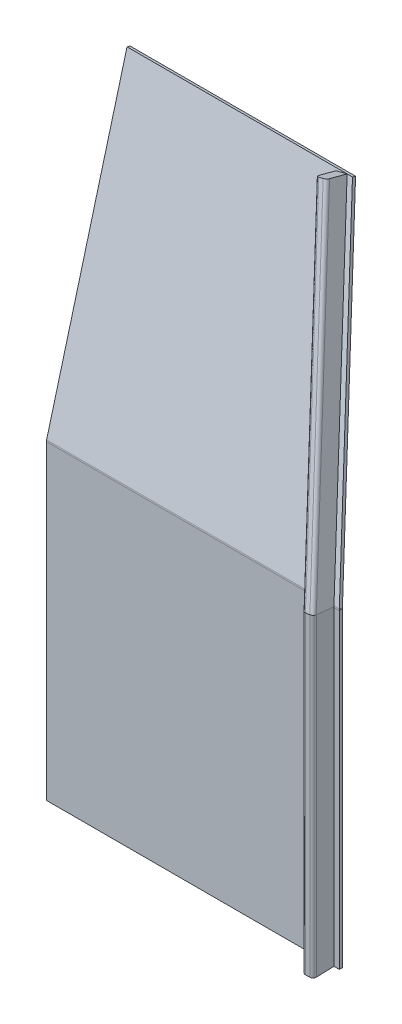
ISO-10303-21;
HEADER;
FILE_DESCRIPTION(('STEP AP214'),'2;1');
FILE_NAME('part.step','',(''),(''),'','','');
FILE_SCHEMA(('AUTOMOTIVE_DESIGN { 1 0 10303 214 1 1 1 1 }'));
ENDSEC;
DATA;
#1=APPLICATION_CONTEXT('core data for automotive mechanical design processes');
#2=APPLICATION_PROTOCOL_DEFINITION('international standard','automotive_design',2000,#1);
#3=PRODUCT_CONTEXT('',#1,'mechanical');
#4=PRODUCT('Part','Part','',(#3));
#5=PRODUCT_RELATED_PRODUCT_CATEGORY('part','',(#4));
#6=PRODUCT_DEFINITION_FORMATION('','',#4);
#7=PRODUCT_DEFINITION_CONTEXT('part definition',#1,'design');
#8=PRODUCT_DEFINITION('design','',#6,#7);
#9=PRODUCT_DEFINITION_SHAPE('','',#8);
#10=(LENGTH_UNIT() NAMED_UNIT(*) SI_UNIT(.MILLI.,.METRE.));
#11=(NAMED_UNIT(*) PLANE_ANGLE_UNIT() SI_UNIT($,.RADIAN.));
#12=(NAMED_UNIT(*) SI_UNIT($,.STERADIAN.) SOLID_ANGLE_UNIT());
#13=UNCERTAINTY_MEASURE_WITH_UNIT(LENGTH_MEASURE(1.E-05),#10,'distance_accuracy_value','');
#14=(GEOMETRIC_REPRESENTATION_CONTEXT(3) GLOBAL_UNCERTAINTY_ASSIGNED_CONTEXT((#13)) GLOBAL_UNIT_ASSIGNED_CONTEXT((#10,
#11,#12)) REPRESENTATION_CONTEXT('',''));
#15=CARTESIAN_POINT('',(0.,0.,0.));
#16=DIRECTION('',(0.,0.,1.));
#17=DIRECTION('',(1.,0.,0.));
#18=AXIS2_PLACEMENT_3D('',#15,#16,#17);
#19=CARTESIAN_POINT('',(266.471755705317,2.77555756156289E-13,20.0777445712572));
#20=DIRECTION('',(0.,-1.,0.));
#21=DIRECTION('',(-0.0281624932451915,0.,-0.999603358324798));
#22=AXIS2_PLACEMENT_3D('',#19,#20,#21);
#23=PLANE('',#22);
#24=CARTESIAN_POINT('',(266.471755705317,2.77555756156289E-13,20.0777445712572));
#25=DIRECTION('',(0.,-1.,0.));
#26=DIRECTION('',(-0.0281624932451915,0.,-0.999603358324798));
#27=AXIS2_PLACEMENT_3D('',#24,#25,#26);
#28=CIRCLE('',#27,2.99999999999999);
#29=CARTESIAN_POINT('',(269.470565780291,0.,19.9932570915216));
#30=VERTEX_POINT('',#29);
#31=CARTESIAN_POINT('',(266.556243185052,1.66533453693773E-13,23.0765546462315));
#32=VERTEX_POINT('',#31);
#33=EDGE_CURVE('E127',#30,#32,#28,.T.);
#34=ORIENTED_EDGE('',*,*,#33,.T.);
#35=DIRECTION('',(-0.999603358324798,0.,0.0281624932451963));
#36=VECTOR('',#35,1.);
#37=CARTESIAN_POINT('',(266.556243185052,1.66533453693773E-13,23.0765546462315));
#38=LINE('',#37,#36);
#39=CARTESIAN_POINT('',(262.557829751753,2.77555756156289E-13,23.1892046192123));
#40=VERTEX_POINT('',#39);
#41=EDGE_CURVE('E117',#32,#40,#38,.T.);
#42=ORIENTED_EDGE('',*,*,#41,.T.);
#43=CARTESIAN_POINT('',(262.473342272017,1.66533453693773E-13,20.190394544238));
#44=DIRECTION('',(0.,-1.,0.));
#45=DIRECTION('',(-0.0281624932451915,0.,-0.999603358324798));
#46=AXIS2_PLACEMENT_3D('',#43,#44,#45);
#47=CIRCLE('',#46,3.);
#48=CARTESIAN_POINT('',(259.474532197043,1.66533453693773E-13,20.2748820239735));
#49=VERTEX_POINT('',#48);
#50=EDGE_CURVE('E126',#40,#49,#47,.T.);
#51=ORIENTED_EDGE('',*,*,#50,.T.);
#52=DIRECTION('',(-0.0281624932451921,0.,-0.999603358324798));
#53=VECTOR('',#52,1.);
#54=CARTESIAN_POINT('',(258.995769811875,0.,3.28162493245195));
#55=LINE('',#54,#53);
#56=CARTESIAN_POINT('',(258.995769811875,0.,3.28162493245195));
#57=VERTEX_POINT('',#56);
#58=EDGE_CURVE('E150',#49,#57,#55,.T.);
#59=ORIENTED_EDGE('',*,*,#58,.T.);
#60=DIRECTION('',(0.999603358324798,0.,-0.0281624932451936));
#61=VECTOR('',#60,1.);
#62=CARTESIAN_POINT('',(258.995769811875,0.,3.28162493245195));
#63=LINE('',#62,#61);
#64=CARTESIAN_POINT('',(268.991803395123,1.66533453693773E-13,3.00000000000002));
#65=VERTEX_POINT('',#64);
#66=EDGE_CURVE('E148',#57,#65,#63,.T.);
#67=ORIENTED_EDGE('',*,*,#66,.T.);
#68=DIRECTION('',(0.0281624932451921,0.,0.999603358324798));
#69=VECTOR('',#68,1.);
#70=CARTESIAN_POINT('',(269.470565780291,0.,19.9932570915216));
#71=LINE('',#70,#69);
#72=EDGE_CURVE('E131',#65,#30,#71,.T.);
#73=ORIENTED_EDGE('',*,*,#72,.T.);
#74=EDGE_LOOP('',(#34,#42,#51,#59,#67,#73));
#75=FACE_BOUND('',#74,.T.);
#76=ADVANCED_FACE('F62',(#75),#23,.T.);
#77=CARTESIAN_POINT('',(269.470565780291,0.,19.9932570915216));
#78=DIRECTION('',(-0.999603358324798,0.,0.0281624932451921));
#79=DIRECTION('',(0.0281624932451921,0.,0.999603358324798));
#80=AXIS2_PLACEMENT_3D('',#77,#78,#79);
#81=PLANE('',#80);
#82=DIRECTION('',(0.,1.,0.));
#83=VECTOR('',#82,1.);
#84=CARTESIAN_POINT('',(268.991803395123,1.66533453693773E-13,3.00000000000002));
#85=LINE('',#84,#83);
#86=CARTESIAN_POINT('',(268.991803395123,291.38547097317,2.99999999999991));
#87=VERTEX_POINT('',#86);
#88=EDGE_CURVE('E142',#65,#87,#85,.T.);
#89=ORIENTED_EDGE('',*,*,#88,.T.);
#90=DIRECTION('',(0.0279161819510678,0.131968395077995,0.990860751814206));
#91=VECTOR('',#90,1.);
#92=CARTESIAN_POINT('',(268.38874808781,288.534642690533,-18.4049269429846));
#93=LINE('',#92,#91);
#94=CARTESIAN_POINT('',(269.470565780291,293.648728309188,19.9932570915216));
#95=VERTEX_POINT('',#94);
#96=EDGE_CURVE('E66',#87,#95,#93,.T.);
#97=ORIENTED_EDGE('',*,*,#96,.T.);
#98=DIRECTION('',(0.,1.,0.));
#99=VECTOR('',#98,1.);
#100=CARTESIAN_POINT('',(269.470565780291,0.,19.9932570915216));
#101=LINE('',#100,#99);
#102=EDGE_CURVE('E145',#30,#95,#101,.T.);
#103=ORIENTED_EDGE('',*,*,#102,.F.);
#104=ORIENTED_EDGE('',*,*,#72,.F.);
#105=EDGE_LOOP('',(#89,#97,#103,#104));
#106=FACE_BOUND('',#105,.T.);
#107=ADVANCED_FACE('F172',(#106),#81,.F.);
#108=CARTESIAN_POINT('',(258.995769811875,0.,3.28162493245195));
#109=DIRECTION('',(0.0281624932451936,0.,0.999603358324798));
#110=DIRECTION('',(0.999603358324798,0.,-0.0281624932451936));
#111=AXIS2_PLACEMENT_3D('',#108,#109,#110);
#112=PLANE('',#111);
#113=DIRECTION('',(0.,1.,0.));
#114=VECTOR('',#113,1.);
#115=CARTESIAN_POINT('',(258.995769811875,0.,3.28162493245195));
#116=LINE('',#115,#114);
#117=CARTESIAN_POINT('',(258.995769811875,290.334432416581,3.28162493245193));
#118=VERTEX_POINT('',#117);
#119=EDGE_CURVE('E140',#57,#118,#116,.T.);
#120=ORIENTED_EDGE('',*,*,#119,.T.);
#121=DIRECTION('',(0.994127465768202,0.104528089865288,-0.0280082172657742));
#122=VECTOR('',#121,1.);
#123=CARTESIAN_POINT('',(228.825886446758,287.162203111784,4.13162121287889));
#124=LINE('',#123,#122);
#125=EDGE_CURVE('E13',#118,#87,#124,.T.);
#126=ORIENTED_EDGE('',*,*,#125,.T.);
#127=ORIENTED_EDGE('',*,*,#88,.F.);
#128=ORIENTED_EDGE('',*,*,#66,.F.);
#129=EDGE_LOOP('',(#120,#126,#127,#128));
#130=FACE_BOUND('',#129,.T.);
#131=ADVANCED_FACE('F170',(#130),#112,.F.);
#132=CARTESIAN_POINT('',(258.995769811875,0.,3.28162493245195));
#133=DIRECTION('',(0.999603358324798,0.,-0.0281624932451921));
#134=DIRECTION('',(-0.0281624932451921,0.,-0.999603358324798));
#135=AXIS2_PLACEMENT_3D('',#132,#133,#134);
#136=PLANE('',#135);
#137=DIRECTION('',(0.,1.,0.));
#138=VECTOR('',#137,1.);
#139=CARTESIAN_POINT('',(259.474532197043,1.66533453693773E-13,20.2748820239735));
#140=LINE('',#139,#138);
#141=CARTESIAN_POINT('',(259.474532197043,292.597689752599,20.2748820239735));
#142=VERTEX_POINT('',#141);
#143=EDGE_CURVE('E135',#49,#142,#140,.T.);
#144=ORIENTED_EDGE('',*,*,#143,.T.);
#145=DIRECTION('',(-0.0279161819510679,-0.131968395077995,-0.990860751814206));
#146=VECTOR('',#145,1.);
#147=CARTESIAN_POINT('',(257.926162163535,285.27806743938,-34.6831741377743));
#148=LINE('',#147,#146);
#149=EDGE_CURVE('E71',#142,#118,#148,.T.);
#150=ORIENTED_EDGE('',*,*,#149,.T.);
#151=ORIENTED_EDGE('',*,*,#119,.F.);
#152=ORIENTED_EDGE('',*,*,#58,.F.);
#153=EDGE_LOOP('',(#144,#150,#151,#152));
#154=FACE_BOUND('',#153,.T.);
#155=ADVANCED_FACE('F161',(#154),#136,.F.);
#156=CARTESIAN_POINT('',(262.473342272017,1.66533453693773E-13,20.190394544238));
#157=DIRECTION('',(0.,1.,0.));
#158=DIRECTION('',(0.,0.,1.));
#159=AXIS2_PLACEMENT_3D('',#156,#157,#158);
#160=CYLINDRICAL_SURFACE('',#159,3.);
#161=DIRECTION('',(0.,1.,0.));
#162=VECTOR('',#161,1.);
#163=CARTESIAN_POINT('',(262.557829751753,2.77555756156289E-13,23.1892046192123));
#164=LINE('',#163,#162);
#165=CARTESIAN_POINT('',(262.557829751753,293.312399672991,23.1892046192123));
#166=VERTEX_POINT('',#165);
#167=EDGE_CURVE('E123',#40,#166,#164,.T.);
#168=ORIENTED_EDGE('',*,*,#167,.T.);
#169=CARTESIAN_POINT('',(262.473342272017,292.913001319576,20.1903945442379));
#170=DIRECTION('',(0.107279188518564,-0.985917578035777,0.128287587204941));
#171=DIRECTION('',(0.632465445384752,0.167231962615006,0.756320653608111));
#172=AXIS2_PLACEMENT_3D('',#169,#170,#171);
#173=ELLIPSE('',#172,3.04285070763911,3.);
#174=EDGE_CURVE('E155',#166,#142,#173,.T.);
#175=ORIENTED_EDGE('',*,*,#174,.T.);
#176=ORIENTED_EDGE('',*,*,#143,.F.);
#177=ORIENTED_EDGE('',*,*,#50,.F.);
#178=EDGE_LOOP('',(#168,#175,#176,#177));
#179=FACE_BOUND('',#178,.T.);
#180=ADVANCED_FACE('F167',(#179),#160,.T.);
#181=CARTESIAN_POINT('',(266.556243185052,1.66533453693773E-13,23.0765546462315));
#182=DIRECTION('',(-0.0281624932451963,0.,-0.999603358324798));
#183=DIRECTION('',(-0.999603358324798,0.,0.0281624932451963));
#184=AXIS2_PLACEMENT_3D('',#181,#182,#183);
#185=PLANE('',#184);
#186=DIRECTION('',(0.,1.,0.));
#187=VECTOR('',#186,1.);
#188=CARTESIAN_POINT('',(266.556243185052,1.66533453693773E-13,23.0765546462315));
#189=LINE('',#188,#187);
#190=CARTESIAN_POINT('',(266.556243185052,293.732815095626,23.0765546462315));
#191=VERTEX_POINT('',#190);
#192=EDGE_CURVE('E121',#32,#191,#189,.T.);
#193=ORIENTED_EDGE('',*,*,#192,.T.);
#194=DIRECTION('',(-0.994127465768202,-0.104528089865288,0.0280082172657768));
#195=VECTOR('',#194,1.);
#196=CARTESIAN_POINT('',(236.033219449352,290.523454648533,23.9365001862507));
#197=LINE('',#196,#195);
#198=EDGE_CURVE('E91',#191,#166,#197,.T.);
#199=ORIENTED_EDGE('',*,*,#198,.T.);
#200=ORIENTED_EDGE('',*,*,#167,.F.);
#201=ORIENTED_EDGE('',*,*,#41,.F.);
#202=EDGE_LOOP('',(#193,#199,#200,#201));
#203=FACE_BOUND('',#202,.T.);
#204=ADVANCED_FACE('F119',(#203),#185,.F.);
#205=CARTESIAN_POINT('',(266.471755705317,2.77555756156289E-13,20.0777445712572));
#206=DIRECTION('',(0.,1.,0.));
#207=DIRECTION('',(0.,0.,1.));
#208=AXIS2_PLACEMENT_3D('',#205,#206,#207);
#209=CYLINDRICAL_SURFACE('',#208,2.99999999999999);
#210=ORIENTED_EDGE('',*,*,#102,.T.);
#211=CARTESIAN_POINT('',(266.471755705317,293.333416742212,20.0777445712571));
#212=DIRECTION('',(0.107279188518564,-0.985917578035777,0.128287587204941));
#213=DIRECTION('',(0.632465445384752,0.167231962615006,0.756320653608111));
#214=AXIS2_PLACEMENT_3D('',#211,#212,#213);
#215=ELLIPSE('',#214,3.0428507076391,2.99999999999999);
#216=EDGE_CURVE('E96',#95,#191,#215,.T.);
#217=ORIENTED_EDGE('',*,*,#216,.T.);
#218=ORIENTED_EDGE('',*,*,#192,.F.);
#219=ORIENTED_EDGE('',*,*,#33,.F.);
#220=EDGE_LOOP('',(#210,#217,#218,#219));
#221=FACE_BOUND('',#220,.T.);
#222=ADVANCED_FACE('F64',(#221),#209,.T.);
#223=CARTESIAN_POINT('',(268.991803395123,291.38547097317,2.99999999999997));
#224=DIRECTION('',(0.107279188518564,-0.985917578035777,0.128287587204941));
#225=DIRECTION('',(0.,-0.129032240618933,-0.991640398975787));
#226=AXIS2_PLACEMENT_3D('',#223,#224,#225);
#227=PLANE('',#226);
#228=ORIENTED_EDGE('',*,*,#96,.F.);
#229=ORIENTED_EDGE('',*,*,#125,.F.);
#230=ORIENTED_EDGE('',*,*,#149,.F.);
#231=ORIENTED_EDGE('',*,*,#174,.F.);
#232=ORIENTED_EDGE('',*,*,#198,.F.);
#233=ORIENTED_EDGE('',*,*,#216,.F.);
#234=EDGE_LOOP('',(#228,#229,#230,#231,#232,#233));
#235=FACE_BOUND('',#234,.T.);
#236=ADVANCED_FACE('F165',(#235),#227,.F.);
#237=CLOSED_SHELL('',(#76,#107,#131,#155,#180,#204,#222,#236));
#238=MANIFOLD_SOLID_BREP('B2',#237);
#239=CARTESIAN_POINT('',(266.059693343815,295.172407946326,19.5849883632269));
#240=DIRECTION('',(-0.211536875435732,0.944066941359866,-0.252961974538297));
#241=DIRECTION('',(0.,0.258819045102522,0.965925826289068));
#242=AXIS2_PLACEMENT_3D('',#239,#240,#241);
#243=CYLINDRICAL_SURFACE('',#242,2.99999999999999);
#244=CARTESIAN_POINT('',(266.471755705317,293.333416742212,20.0777445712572));
#245=DIRECTION('',(0.107279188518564,-0.985917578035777,0.128287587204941));
#246=DIRECTION('',(-0.632465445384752,-0.167231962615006,-0.756320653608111));
#247=AXIS2_PLACEMENT_3D('',#244,#245,#246);
#248=ELLIPSE('',#247,3.0428507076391,2.99999999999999);
#249=CARTESIAN_POINT('',(269.470565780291,293.648728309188,19.9932570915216));
#250=VERTEX_POINT('',#249);
#251=CARTESIAN_POINT('',(266.556243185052,293.732815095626,23.0765546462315));
#252=VERTEX_POINT('',#251);
#253=EDGE_CURVE('E344',#250,#252,#248,.T.);
#254=ORIENTED_EDGE('',*,*,#253,.F.);
#255=DIRECTION('',(-0.211536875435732,0.944066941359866,-0.252961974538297));
#256=VECTOR('',#255,1.);
#257=CARTESIAN_POINT('',(268.991803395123,295.785394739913,19.4207390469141));
#258=LINE('',#257,#256);
#259=CARTESIAN_POINT('',(205.925849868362,577.242146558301,-55.9953703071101));
#260=VERTEX_POINT('',#259);
#261=EDGE_CURVE('E267',#250,#260,#258,.T.);
#262=ORIENTED_EDGE('',*,*,#261,.T.);
#263=CARTESIAN_POINT('',(202.993739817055,576.629159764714,-55.8311209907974));
#264=DIRECTION('',(0.211536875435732,-0.944066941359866,0.252961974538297));
#265=DIRECTION('',(0.,-0.258819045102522,-0.965925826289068));
#266=AXIS2_PLACEMENT_3D('',#263,#264,#265);
#267=CIRCLE('',#266,2.99999999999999);
#268=CARTESIAN_POINT('',(202.993739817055,577.405616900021,-52.9333435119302));
#269=VERTEX_POINT('',#268);
#270=EDGE_CURVE('E352',#260,#269,#267,.T.);
#271=ORIENTED_EDGE('',*,*,#270,.T.);
#272=DIRECTION('',(-0.211536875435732,0.944066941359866,-0.252961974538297));
#273=VECTOR('',#272,1.);
#274=CARTESIAN_POINT('',(266.059693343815,295.948865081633,22.4827658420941));
#275=LINE('',#274,#273);
#276=EDGE_CURVE('E310',#252,#269,#275,.T.);
#277=ORIENTED_EDGE('',*,*,#276,.F.);
#278=EDGE_LOOP('',(#254,#262,#271,#277));
#279=FACE_BOUND('',#278,.T.);
#280=ADVANCED_FACE('F263',(#279),#243,.T.);
#281=CARTESIAN_POINT('',(266.059693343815,295.948865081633,22.4827658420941));
#282=DIRECTION('',(0.,-0.258819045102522,-0.965925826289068));
#283=DIRECTION('',(0.,0.965925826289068,-0.258819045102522));
#284=AXIS2_PLACEMENT_3D('',#281,#282,#283);
#285=PLANE('',#284);
#286=DIRECTION('',(-0.994127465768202,-0.104528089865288,0.0280082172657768));
#287=VECTOR('',#286,1.);
#288=CARTESIAN_POINT('',(266.312320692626,293.707167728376,23.0834268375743));
#289=LINE('',#288,#287);
#290=CARTESIAN_POINT('',(262.557829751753,293.312399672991,23.1892046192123));
#291=VERTEX_POINT('',#290);
#292=EDGE_CURVE('E317',#252,#291,#289,.T.);
#293=ORIENTED_EDGE('',*,*,#292,.F.);
#294=ORIENTED_EDGE('',*,*,#276,.T.);
#295=DIRECTION('',(-0.977370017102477,-0.204328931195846,0.0547497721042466));
#296=VECTOR('',#295,1.);
#297=CARTESIAN_POINT('',(202.993739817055,577.405616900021,-52.9333435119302));
#298=LINE('',#297,#296);
#299=CARTESIAN_POINT('',(199.084259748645,576.588301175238,-52.7143444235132));
#300=VERTEX_POINT('',#299);
#301=EDGE_CURVE('E351',#269,#300,#298,.T.);
#302=ORIENTED_EDGE('',*,*,#301,.T.);
#303=DIRECTION('',(-0.211536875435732,0.944066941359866,-0.252961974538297));
#304=VECTOR('',#303,1.);
#305=CARTESIAN_POINT('',(262.150213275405,295.13154935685,22.7017649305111));
#306=LINE('',#305,#304);
#307=EDGE_CURVE('E353',#291,#300,#306,.T.);
#308=ORIENTED_EDGE('',*,*,#307,.F.);
#309=EDGE_LOOP('',(#293,#294,#302,#308));
#310=FACE_BOUND('',#309,.T.);
#311=ADVANCED_FACE('F371',(#310),#285,.F.);
#312=CARTESIAN_POINT('',(262.150213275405,294.355092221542,19.8039874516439));
#313=DIRECTION('',(-0.211536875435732,0.944066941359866,-0.252961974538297));
#314=DIRECTION('',(0.,0.258819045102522,0.965925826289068));
#315=AXIS2_PLACEMENT_3D('',#312,#313,#314);
#316=CYLINDRICAL_SURFACE('',#315,3.);
#317=CARTESIAN_POINT('',(262.473342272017,292.913001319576,20.1903945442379));
#318=DIRECTION('',(0.107279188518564,-0.985917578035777,0.128287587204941));
#319=DIRECTION('',(-0.632465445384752,-0.167231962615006,-0.756320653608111));
#320=AXIS2_PLACEMENT_3D('',#317,#318,#319);
#321=ELLIPSE('',#320,3.04285070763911,3.);
#322=CARTESIAN_POINT('',(259.474532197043,292.597689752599,20.2748820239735));
#323=VERTEX_POINT('',#322);
#324=EDGE_CURVE('E338',#291,#323,#321,.T.);
#325=ORIENTED_EDGE('',*,*,#324,.F.);
#326=ORIENTED_EDGE('',*,*,#307,.T.);
#327=CARTESIAN_POINT('',(199.084259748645,575.81184403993,-55.6121219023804));
#328=DIRECTION('',(0.211536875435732,-0.944066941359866,0.252961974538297));
#329=DIRECTION('',(0.,-0.258819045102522,-0.965925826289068));
#330=AXIS2_PLACEMENT_3D('',#327,#328,#329);
#331=CIRCLE('',#330,3.);
#332=CARTESIAN_POINT('',(196.152149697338,575.198857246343,-55.4478725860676));
#333=VERTEX_POINT('',#332);
#334=EDGE_CURVE('E355',#300,#333,#331,.T.);
#335=ORIENTED_EDGE('',*,*,#334,.T.);
#336=DIRECTION('',(-0.211536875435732,0.944066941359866,-0.252961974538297));
#337=VECTOR('',#336,1.);
#338=CARTESIAN_POINT('',(259.218103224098,293.742105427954,19.9682367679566));
#339=LINE('',#338,#337);
#340=EDGE_CURVE('E356',#323,#333,#339,.T.);
#341=ORIENTED_EDGE('',*,*,#340,.F.);
#342=EDGE_LOOP('',(#325,#326,#335,#341));
#343=FACE_BOUND('',#342,.T.);
#344=ADVANCED_FACE('F373',(#343),#316,.T.);
#345=CARTESIAN_POINT('',(259.218103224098,289.342181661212,3.54749772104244));
#346=DIRECTION('',(0.977370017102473,0.204328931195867,-0.0547497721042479));
#347=DIRECTION('',(-0.204635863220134,0.978838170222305,0.));
#348=AXIS2_PLACEMENT_3D('',#345,#346,#347);
#349=PLANE('',#348);
#350=DIRECTION('',(-0.0279161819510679,-0.131968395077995,-0.990860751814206));
#351=VECTOR('',#350,1.);
#352=CARTESIAN_POINT('',(258.999641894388,290.352736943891,3.41906115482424));
#353=LINE('',#352,#351);
#354=CARTESIAN_POINT('',(258.995769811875,290.334432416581,3.28162493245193));
#355=VERTEX_POINT('',#354);
#356=EDGE_CURVE('E272',#323,#355,#353,.T.);
#357=ORIENTED_EDGE('',*,*,#356,.F.);
#358=ORIENTED_EDGE('',*,*,#340,.T.);
#359=DIRECTION('',(0.,-0.258819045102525,-0.965925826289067));
#360=VECTOR('',#359,1.);
#361=CARTESIAN_POINT('',(196.152149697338,570.7989334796,-71.8686116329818));
#362=LINE('',#361,#360);
#363=CARTESIAN_POINT('',(196.152149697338,570.7989334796,-71.8686116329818));
#364=VERTEX_POINT('',#363);
#365=EDGE_CURVE('E333',#333,#364,#362,.T.);
#366=ORIENTED_EDGE('',*,*,#365,.T.);
#367=DIRECTION('',(-0.211536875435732,0.944066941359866,-0.252961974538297));
#368=VECTOR('',#367,1.);
#369=CARTESIAN_POINT('',(259.218103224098,289.342181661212,3.54749772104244));
#370=LINE('',#369,#368);
#371=EDGE_CURVE('E324',#355,#364,#370,.T.);
#372=ORIENTED_EDGE('',*,*,#371,.F.);
#373=EDGE_LOOP('',(#357,#358,#366,#372));
#374=FACE_BOUND('',#373,.T.);
#375=ADVANCED_FACE('F330',(#374),#349,.F.);
#376=CARTESIAN_POINT('',(259.218103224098,289.342181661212,3.54749772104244));
#377=DIRECTION('',(0.,0.258819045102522,0.965925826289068));
#378=DIRECTION('',(0.,-0.965925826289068,0.258819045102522));
#379=AXIS2_PLACEMENT_3D('',#376,#377,#378);
#380=PLANE('',#379);
#381=DIRECTION('',(0.994127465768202,0.104528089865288,-0.0280082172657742));
#382=VECTOR('',#381,1.);
#383=CARTESIAN_POINT('',(259.104987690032,290.345916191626,3.27854786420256));
#384=LINE('',#383,#382);
#385=CARTESIAN_POINT('',(268.991803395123,291.38547097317,2.99999999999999));
#386=VERTEX_POINT('',#385);
#387=EDGE_CURVE('E60',#355,#386,#384,.T.);
#388=ORIENTED_EDGE('',*,*,#387,.F.);
#389=ORIENTED_EDGE('',*,*,#371,.T.);
#390=DIRECTION('',(0.977370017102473,0.204328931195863,-0.0547497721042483));
#391=VECTOR('',#390,1.);
#392=CARTESIAN_POINT('',(196.152149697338,570.7989334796,-71.8686116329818));
#393=LINE('',#392,#391);
#394=CARTESIAN_POINT('',(205.925849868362,572.842222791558,-72.4161093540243));
#395=VERTEX_POINT('',#394);
#396=EDGE_CURVE('E335',#364,#395,#393,.T.);
#397=ORIENTED_EDGE('',*,*,#396,.T.);
#398=DIRECTION('',(-0.211536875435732,0.944066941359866,-0.252961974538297));
#399=VECTOR('',#398,1.);
#400=CARTESIAN_POINT('',(268.991803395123,291.38547097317,2.99999999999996));
#401=LINE('',#400,#399);
#402=EDGE_CURVE('E285',#386,#395,#401,.T.);
#403=ORIENTED_EDGE('',*,*,#402,.F.);
#404=EDGE_LOOP('',(#388,#389,#397,#403));
#405=FACE_BOUND('',#404,.T.);
#406=ADVANCED_FACE('F323',(#405),#380,.F.);
#407=CARTESIAN_POINT('',(268.991803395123,295.785394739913,19.4207390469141));
#408=DIRECTION('',(-0.977370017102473,-0.204328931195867,0.0547497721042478));
#409=DIRECTION('',(0.204635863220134,-0.978838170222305,0.));
#410=AXIS2_PLACEMENT_3D('',#407,#408,#409);
#411=PLANE('',#410);
#412=DIRECTION('',(0.0279161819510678,0.131968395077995,0.990860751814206));
#413=VECTOR('',#412,1.);
#414=CARTESIAN_POINT('',(269.462227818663,293.609312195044,19.697308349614));
#415=LINE('',#414,#413);
#416=EDGE_CURVE('E347',#386,#250,#415,.T.);
#417=ORIENTED_EDGE('',*,*,#416,.F.);
#418=ORIENTED_EDGE('',*,*,#402,.T.);
#419=DIRECTION('',(0.,0.258819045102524,0.965925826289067));
#420=VECTOR('',#419,1.);
#421=CARTESIAN_POINT('',(205.925849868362,577.242146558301,-55.9953703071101));
#422=LINE('',#421,#420);
#423=EDGE_CURVE('E349',#395,#260,#422,.T.);
#424=ORIENTED_EDGE('',*,*,#423,.T.);
#425=ORIENTED_EDGE('',*,*,#261,.F.);
#426=EDGE_LOOP('',(#417,#418,#424,#425));
#427=FACE_BOUND('',#426,.T.);
#428=ADVANCED_FACE('F367',(#427),#411,.F.);
#429=CARTESIAN_POINT('',(202.993739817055,576.629159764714,-55.8311209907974));
#430=DIRECTION('',(0.211536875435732,-0.944066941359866,0.252961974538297));
#431=DIRECTION('',(0.,-0.258819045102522,-0.965925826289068));
#432=AXIS2_PLACEMENT_3D('',#429,#430,#431);
#433=PLANE('',#432);
#434=ORIENTED_EDGE('',*,*,#270,.F.);
#435=ORIENTED_EDGE('',*,*,#423,.F.);
#436=ORIENTED_EDGE('',*,*,#396,.F.);
#437=ORIENTED_EDGE('',*,*,#365,.F.);
#438=ORIENTED_EDGE('',*,*,#334,.F.);
#439=ORIENTED_EDGE('',*,*,#301,.F.);
#440=EDGE_LOOP('',(#434,#435,#436,#437,#438,#439));
#441=FACE_BOUND('',#440,.T.);
#442=ADVANCED_FACE('F369',(#441),#433,.F.);
#443=CARTESIAN_POINT('',(268.991803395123,291.38547097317,2.99999999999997));
#444=DIRECTION('',(0.107279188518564,-0.985917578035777,0.128287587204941));
#445=DIRECTION('',(0.,-0.129032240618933,-0.991640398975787));
#446=AXIS2_PLACEMENT_3D('',#443,#444,#445);
#447=PLANE('',#446);
#448=ORIENTED_EDGE('',*,*,#416,.T.);
#449=ORIENTED_EDGE('',*,*,#253,.T.);
#450=ORIENTED_EDGE('',*,*,#292,.T.);
#451=ORIENTED_EDGE('',*,*,#324,.T.);
#452=ORIENTED_EDGE('',*,*,#356,.T.);
#453=ORIENTED_EDGE('',*,*,#387,.T.);
#454=EDGE_LOOP('',(#448,#449,#450,#451,#452,#453));
#455=FACE_BOUND('',#454,.T.);
#456=ADVANCED_FACE('F265',(#455),#447,.T.);
#457=CLOSED_SHELL('',(#280,#311,#344,#375,#406,#428,#442,#456));
#458=MANIFOLD_SOLID_BREP('B7',#457);
#459=CARTESIAN_POINT('',(0.,572.842222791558,-72.4161093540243));
#460=DIRECTION('',(0.,-0.258819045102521,-0.965925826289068));
#461=DIRECTION('',(-1.,0.,0.));
#462=AXIS2_PLACEMENT_3D('',#459,#460,#461);
#463=PLANE('',#462);
#464=DIRECTION('',(0.,-0.965925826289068,0.258819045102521));
#465=VECTOR('',#464,1.);
#466=CARTESIAN_POINT('',(0.,9.93599068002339,78.414160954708));
#467=LINE('',#466,#465);
#468=CARTESIAN_POINT('',(0.,572.842222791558,-72.4161093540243));
#469=VERTEX_POINT('',#468);
#470=CARTESIAN_POINT('',(0.,292.021303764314,2.82962933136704));
#471=VERTEX_POINT('',#470);
#472=EDGE_CURVE('E503',#469,#471,#467,.T.);
#473=ORIENTED_EDGE('',*,*,#472,.T.);
#474=DIRECTION('',(1.,0.,0.));
#475=VECTOR('',#474,1.);
#476=CARTESIAN_POINT('',(0.,292.021303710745,2.82962913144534));
#477=LINE('',#476,#475);
#478=CARTESIAN_POINT('',(273.850147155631,292.021303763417,2.82962932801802));
#479=VERTEX_POINT('',#478);
#480=EDGE_CURVE('E538',#471,#479,#477,.T.);
#481=ORIENTED_EDGE('',*,*,#480,.T.);
#482=DIRECTION('',(-0.211536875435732,0.944066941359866,-0.252961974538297));
#483=VECTOR('',#482,1.);
#484=CARTESIAN_POINT('',(273.991803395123,291.389106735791,2.99902580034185));
#485=LINE('',#484,#483);
#486=CARTESIAN_POINT('',(210.926664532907,572.842222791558,-72.4161093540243));
#487=VERTEX_POINT('',#486);
#488=EDGE_CURVE('E525',#479,#487,#485,.T.);
#489=ORIENTED_EDGE('',*,*,#488,.T.);
#490=DIRECTION('',(-1.,0.,0.));
#491=VECTOR('',#490,1.);
#492=CARTESIAN_POINT('',(0.,572.842222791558,-72.4161093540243));
#493=LINE('',#492,#491);
#494=EDGE_CURVE('E480',#487,#469,#493,.T.);
#495=ORIENTED_EDGE('',*,*,#494,.T.);
#496=EDGE_LOOP('',(#473,#481,#489,#495));
#497=FACE_BOUND('',#496,.T.);
#498=ADVANCED_FACE('F455',(#497),#463,.F.);
#499=CARTESIAN_POINT('',(273.991803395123,291.389106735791,2.99902580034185));
#500=DIRECTION('',(-0.977370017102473,-0.204328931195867,0.0547497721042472));
#501=DIRECTION('',(0.211536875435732,-0.944066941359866,0.252961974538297));
#502=AXIS2_PLACEMENT_3D('',#499,#500,#501);
#503=PLANE('',#502);
#504=ORIENTED_EDGE('',*,*,#488,.F.);
#505=CARTESIAN_POINT('',(273.850147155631,291.244846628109,-0.0681481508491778));
#506=CARTESIAN_POINT('',(273.850147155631,292.021303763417,2.82962932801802));
#507=B_SPLINE_CURVE_WITH_KNOTS('',1,(#505,#506),.UNSPECIFIED.,.F.,.F.,(2,2),(0.,1.),.UNSPECIFIED.);
#508=CARTESIAN_POINT('',(273.850147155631,291.244846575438,-0.0681483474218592));
#509=VERTEX_POINT('',#508);
#510=EDGE_CURVE('E261',#479,#509,#507,.F.);
#511=ORIENTED_EDGE('',*,*,#510,.T.);
#512=DIRECTION('',(-0.211536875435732,0.944066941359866,-0.252961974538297));
#513=VECTOR('',#512,1.);
#514=CARTESIAN_POINT('',(273.991803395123,290.612649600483,0.101248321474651));
#515=LINE('',#514,#513);
#516=CARTESIAN_POINT('',(210.926664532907,572.06576565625,-75.3138868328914));
#517=VERTEX_POINT('',#516);
#518=EDGE_CURVE('E504',#509,#517,#515,.T.);
#519=ORIENTED_EDGE('',*,*,#518,.T.);
#520=DIRECTION('',(0.,-0.258819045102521,-0.965925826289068));
#521=VECTOR('',#520,1.);
#522=CARTESIAN_POINT('',(210.926664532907,572.842222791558,-72.4161093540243));
#523=LINE('',#522,#521);
#524=EDGE_CURVE('E499',#487,#517,#523,.T.);
#525=ORIENTED_EDGE('',*,*,#524,.F.);
#526=EDGE_LOOP('',(#504,#511,#519,#525));
#527=FACE_BOUND('',#526,.T.);
#528=ADVANCED_FACE('F457',(#527),#503,.F.);
#529=CARTESIAN_POINT('',(0.,9.93599068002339,78.414160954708));
#530=DIRECTION('',(1.,0.,0.));
#531=DIRECTION('',(0.,-0.258819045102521,-0.965925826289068));
#532=AXIS2_PLACEMENT_3D('',#529,#530,#531);
#533=PLANE('',#532);
#534=DIRECTION('',(0.,-0.965925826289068,0.258819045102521));
#535=VECTOR('',#534,1.);
#536=CARTESIAN_POINT('',(0.,9.15953354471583,75.5163834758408));
#537=LINE('',#536,#535);
#538=CARTESIAN_POINT('',(0.,572.06576565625,-75.3138868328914));
#539=VERTEX_POINT('',#538);
#540=CARTESIAN_POINT('',(0.,291.244846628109,-0.0681481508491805));
#541=VERTEX_POINT('',#540);
#542=EDGE_CURVE('E511',#539,#541,#537,.T.);
#543=ORIENTED_EDGE('',*,*,#542,.T.);
#544=DIRECTION('',(0.,0.258819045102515,0.96592582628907));
#545=VECTOR('',#544,1.);
#546=CARTESIAN_POINT('',(0.,292.021303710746,2.82962913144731));
#547=LINE('',#546,#545);
#548=EDGE_CURVE('E522',#541,#471,#547,.T.);
#549=ORIENTED_EDGE('',*,*,#548,.T.);
#550=ORIENTED_EDGE('',*,*,#472,.F.);
#551=DIRECTION('',(0.,-0.258819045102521,-0.965925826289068));
#552=VECTOR('',#551,1.);
#553=CARTESIAN_POINT('',(0.,572.842222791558,-72.4161093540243));
#554=LINE('',#553,#552);
#555=EDGE_CURVE('E496',#469,#539,#554,.T.);
#556=ORIENTED_EDGE('',*,*,#555,.T.);
#557=EDGE_LOOP('',(#543,#549,#550,#556));
#558=FACE_BOUND('',#557,.T.);
#559=ADVANCED_FACE('F508',(#558),#533,.F.);
#560=CARTESIAN_POINT('',(0.,572.842222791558,-72.4161093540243));
#561=DIRECTION('',(0.,-0.965925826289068,0.258819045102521));
#562=DIRECTION('',(0.,-0.258819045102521,-0.965925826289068));
#563=AXIS2_PLACEMENT_3D('',#560,#561,#562);
#564=PLANE('',#563);
#565=DIRECTION('',(-1.,0.,0.));
#566=VECTOR('',#565,1.);
#567=CARTESIAN_POINT('',(0.,572.06576565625,-75.3138868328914));
#568=LINE('',#567,#566);
#569=EDGE_CURVE('E493',#517,#539,#568,.T.);
#570=ORIENTED_EDGE('',*,*,#569,.T.);
#571=ORIENTED_EDGE('',*,*,#555,.F.);
#572=ORIENTED_EDGE('',*,*,#494,.F.);
#573=ORIENTED_EDGE('',*,*,#524,.T.);
#574=EDGE_LOOP('',(#570,#571,#572,#573));
#575=FACE_BOUND('',#574,.T.);
#576=ADVANCED_FACE('F495',(#575),#564,.F.);
#577=CARTESIAN_POINT('',(0.,572.06576565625,-75.3138868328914));
#578=DIRECTION('',(0.,-0.258819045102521,-0.965925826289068));
#579=DIRECTION('',(-1.,0.,0.));
#580=AXIS2_PLACEMENT_3D('',#577,#578,#579);
#581=PLANE('',#580);
#582=DIRECTION('',(1.,0.,0.));
#583=VECTOR('',#582,1.);
#584=CARTESIAN_POINT('',(0.,291.244846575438,-0.0681483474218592));
#585=LINE('',#584,#583);
#586=EDGE_CURVE('E465',#541,#509,#585,.T.);
#587=ORIENTED_EDGE('',*,*,#586,.F.);
#588=ORIENTED_EDGE('',*,*,#542,.F.);
#589=ORIENTED_EDGE('',*,*,#569,.F.);
#590=ORIENTED_EDGE('',*,*,#518,.F.);
#591=EDGE_LOOP('',(#587,#588,#589,#590));
#592=FACE_BOUND('',#591,.T.);
#593=ADVANCED_FACE('F513',(#592),#581,.T.);
#594=CARTESIAN_POINT('',(0.,0.,3.));
#595=DIRECTION('',(0.,1.,0.));
#596=DIRECTION('',(0.,0.,1.));
#597=AXIS2_PLACEMENT_3D('',#594,#595,#596);
#598=PLANE('',#597);
#599=DIRECTION('',(1.,0.,0.));
#600=VECTOR('',#599,1.);
#601=CARTESIAN_POINT('',(0.,0.,0.));
#602=LINE('',#601,#600);
#603=CARTESIAN_POINT('',(0.,0.,0.));
#604=VERTEX_POINT('',#603);
#605=CARTESIAN_POINT('',(273.991803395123,0.,0.));
#606=VERTEX_POINT('',#605);
#607=EDGE_CURVE('E559',#604,#606,#602,.T.);
#608=ORIENTED_EDGE('',*,*,#607,.T.);
#609=DIRECTION('',(0.,0.,-1.));
#610=VECTOR('',#609,1.);
#611=CARTESIAN_POINT('',(273.991803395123,0.,3.));
#612=LINE('',#611,#610);
#613=CARTESIAN_POINT('',(273.991803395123,0.,3.));
#614=VERTEX_POINT('',#613);
#615=EDGE_CURVE('E518',#614,#606,#612,.T.);
#616=ORIENTED_EDGE('',*,*,#615,.F.);
#617=DIRECTION('',(1.,0.,0.));
#618=VECTOR('',#617,1.);
#619=CARTESIAN_POINT('',(0.,0.,3.));
#620=LINE('',#619,#618);
#621=CARTESIAN_POINT('',(0.,0.,3.));
#622=VERTEX_POINT('',#621);
#623=EDGE_CURVE('E568',#622,#614,#620,.T.);
#624=ORIENTED_EDGE('',*,*,#623,.F.);
#625=DIRECTION('',(0.,0.,-1.));
#626=VECTOR('',#625,1.);
#627=CARTESIAN_POINT('',(0.,0.,3.));
#628=LINE('',#627,#626);
#629=EDGE_CURVE('E562',#622,#604,#628,.T.);
#630=ORIENTED_EDGE('',*,*,#629,.T.);
#631=EDGE_LOOP('',(#608,#616,#624,#630));
#632=FACE_BOUND('',#631,.T.);
#633=ADVANCED_FACE('F707',(#632),#598,.F.);
#634=CARTESIAN_POINT('',(0.,582.763413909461,3.));
#635=DIRECTION('',(0.,0.,-1.));
#636=DIRECTION('',(-1.,0.,0.));
#637=AXIS2_PLACEMENT_3D('',#634,#635,#636);
#638=PLANE('',#637);
#639=DIRECTION('',(1.,0.,0.));
#640=VECTOR('',#639,1.);
#641=CARTESIAN_POINT('',(0.,290.727208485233,3.));
#642=LINE('',#641,#640);
#643=CARTESIAN_POINT('',(0.,290.727208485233,3.00000020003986));
#644=VERTEX_POINT('',#643);
#645=CARTESIAN_POINT('',(273.991803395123,290.727208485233,3.));
#646=VERTEX_POINT('',#645);
#647=EDGE_CURVE('E549',#644,#646,#642,.T.);
#648=ORIENTED_EDGE('',*,*,#647,.F.);
#649=DIRECTION('',(0.,-1.,0.));
#650=VECTOR('',#649,1.);
#651=CARTESIAN_POINT('',(0.,0.,3.));
#652=LINE('',#651,#650);
#653=EDGE_CURVE('E565',#644,#622,#652,.T.);
#654=ORIENTED_EDGE('',*,*,#653,.T.);
#655=ORIENTED_EDGE('',*,*,#623,.T.);
#656=DIRECTION('',(0.,1.,0.));
#657=VECTOR('',#656,1.);
#658=CARTESIAN_POINT('',(273.991803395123,0.,3.));
#659=LINE('',#658,#657);
#660=EDGE_CURVE('E571',#614,#646,#659,.T.);
#661=ORIENTED_EDGE('',*,*,#660,.T.);
#662=EDGE_LOOP('',(#648,#654,#655,#661));
#663=FACE_BOUND('',#662,.T.);
#664=ADVANCED_FACE('F712',(#663),#638,.F.);
#665=CARTESIAN_POINT('',(0.,0.,3.));
#666=DIRECTION('',(1.,0.,0.));
#667=DIRECTION('',(0.,0.,-1.));
#668=AXIS2_PLACEMENT_3D('',#665,#666,#667);
#669=PLANE('',#668);
#670=DIRECTION('',(0.,0.,1.));
#671=VECTOR('',#670,1.);
#672=CARTESIAN_POINT('',(0.,290.727208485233,3.00000000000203));
#673=LINE('',#672,#671);
#674=CARTESIAN_POINT('',(0.,290.727208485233,0.));
#675=VERTEX_POINT('',#674);
#676=EDGE_CURVE('E556',#675,#644,#673,.T.);
#677=ORIENTED_EDGE('',*,*,#676,.F.);
#678=DIRECTION('',(0.,-1.,0.));
#679=VECTOR('',#678,1.);
#680=CARTESIAN_POINT('',(0.,0.,0.));
#681=LINE('',#680,#679);
#682=EDGE_CURVE('E574',#675,#604,#681,.T.);
#683=ORIENTED_EDGE('',*,*,#682,.T.);
#684=ORIENTED_EDGE('',*,*,#629,.F.);
#685=ORIENTED_EDGE('',*,*,#653,.F.);
#686=EDGE_LOOP('',(#677,#683,#684,#685));
#687=FACE_BOUND('',#686,.T.);
#688=ADVANCED_FACE('F759',(#687),#669,.F.);
#689=CARTESIAN_POINT('',(0.,582.763413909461,0.));
#690=DIRECTION('',(0.,0.,-1.));
#691=DIRECTION('',(-1.,0.,0.));
#692=AXIS2_PLACEMENT_3D('',#689,#690,#691);
#693=PLANE('',#692);
#694=ORIENTED_EDGE('',*,*,#682,.F.);
#695=DIRECTION('',(1.,0.,0.));
#696=VECTOR('',#695,1.);
#697=CARTESIAN_POINT('',(0.,290.727208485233,0.));
#698=LINE('',#697,#696);
#699=CARTESIAN_POINT('',(273.991803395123,290.727208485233,0.));
#700=VERTEX_POINT('',#699);
#701=EDGE_CURVE('E577',#675,#700,#698,.T.);
#702=ORIENTED_EDGE('',*,*,#701,.T.);
#703=DIRECTION('',(0.,1.,0.));
#704=VECTOR('',#703,1.);
#705=CARTESIAN_POINT('',(273.991803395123,0.,0.));
#706=LINE('',#705,#704);
#707=EDGE_CURVE('E514',#606,#700,#706,.T.);
#708=ORIENTED_EDGE('',*,*,#707,.F.);
#709=ORIENTED_EDGE('',*,*,#607,.F.);
#710=EDGE_LOOP('',(#694,#702,#708,#709));
#711=FACE_BOUND('',#710,.T.);
#712=ADVANCED_FACE('F752',(#711),#693,.T.);
#713=CARTESIAN_POINT('',(273.991803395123,0.,3.));
#714=DIRECTION('',(-1.,0.,0.));
#715=DIRECTION('',(0.,0.,1.));
#716=AXIS2_PLACEMENT_3D('',#713,#714,#715);
#717=PLANE('',#716);
#718=DIRECTION('',(0.,0.,-1.));
#719=VECTOR('',#718,1.);
#720=CARTESIAN_POINT('',(273.991803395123,290.727208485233,3.00000000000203));
#721=LINE('',#720,#719);
#722=EDGE_CURVE('E552',#646,#700,#721,.T.);
#723=ORIENTED_EDGE('',*,*,#722,.F.);
#724=ORIENTED_EDGE('',*,*,#660,.F.);
#725=ORIENTED_EDGE('',*,*,#615,.T.);
#726=ORIENTED_EDGE('',*,*,#707,.T.);
#727=EDGE_LOOP('',(#723,#724,#725,#726));
#728=FACE_BOUND('',#727,.T.);
#729=ADVANCED_FACE('F738',(#728),#717,.F.);
#730=CARTESIAN_POINT('',(0.,290.727208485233,-2.00000020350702));
#731=DIRECTION('',(-1.,0.,0.));
#732=DIRECTION('',(0.,0.,1.));
#733=AXIS2_PLACEMENT_3D('',#730,#731,#732);
#734=PLANE('',#733);
#735=ORIENTED_EDGE('',*,*,#548,.F.);
#736=CARTESIAN_POINT('',(0.,290.727208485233,-2.));
#737=DIRECTION('',(-1.,0.,0.));
#738=DIRECTION('',(0.,0.,1.));
#739=AXIS2_PLACEMENT_3D('',#736,#737,#738);
#740=CIRCLE('',#739,2.00000020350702);
#741=EDGE_CURVE('E671',#541,#675,#740,.F.);
#742=ORIENTED_EDGE('',*,*,#741,.T.);
#743=ORIENTED_EDGE('',*,*,#676,.T.);
#744=CARTESIAN_POINT('',(0.,290.727208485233,-2.00000020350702));
#745=DIRECTION('',(1.,0.,0.));
#746=DIRECTION('',(0.,0.,-1.));
#747=AXIS2_PLACEMENT_3D('',#744,#745,#746);
#748=CIRCLE('',#747,5.00000040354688);
#749=EDGE_CURVE('E663',#471,#644,#748,.T.);
#750=ORIENTED_EDGE('',*,*,#749,.F.);
#751=EDGE_LOOP('',(#735,#742,#743,#750));
#752=FACE_BOUND('',#751,.T.);
#753=ADVANCED_FACE('F766',(#752),#734,.T.);
#754=CARTESIAN_POINT('',(273.991803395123,290.727208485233,-2.00000020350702));
#755=DIRECTION('',(1.,0.,0.));
#756=DIRECTION('',(0.,0.,-1.));
#757=AXIS2_PLACEMENT_3D('',#754,#755,#756);
#758=PLANE('',#757);
#759=ORIENTED_EDGE('',*,*,#722,.T.);
#760=CARTESIAN_POINT('',(273.991803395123,290.727208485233,-2.));
#761=DIRECTION('',(-1.,0.,0.));
#762=DIRECTION('',(0.,0.,1.));
#763=AXIS2_PLACEMENT_3D('',#760,#761,#762);
#764=CIRCLE('',#763,2.00000020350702);
#765=CARTESIAN_POINT('',(273.991803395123,290.988260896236,-0.0171100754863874));
#766=VERTEX_POINT('',#765);
#767=EDGE_CURVE('E652',#700,#766,#764,.T.);
#768=ORIENTED_EDGE('',*,*,#767,.T.);
#769=CARTESIAN_POINT('',(273.991803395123,291.379839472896,2.95722450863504));
#770=CARTESIAN_POINT('',(273.991803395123,290.988260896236,-0.0171100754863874));
#771=B_SPLINE_CURVE_WITH_KNOTS('',1,(#769,#770),.UNSPECIFIED.,.F.,.F.,(2,2),(0.,1.),.UNSPECIFIED.);
#772=CARTESIAN_POINT('',(273.991803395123,291.37983947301,2.95722450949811));
#773=VERTEX_POINT('',#772);
#774=EDGE_CURVE('E553',#766,#773,#771,.F.);
#775=ORIENTED_EDGE('',*,*,#774,.T.);
#776=CARTESIAN_POINT('',(273.991803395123,290.727208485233,-2.00000020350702));
#777=DIRECTION('',(-1.,0.,0.));
#778=DIRECTION('',(0.,0.,1.));
#779=AXIS2_PLACEMENT_3D('',#776,#777,#778);
#780=CIRCLE('',#779,5.00000040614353);
#781=EDGE_CURVE('E650',#646,#773,#780,.T.);
#782=ORIENTED_EDGE('',*,*,#781,.F.);
#783=EDGE_LOOP('',(#759,#768,#775,#782));
#784=FACE_BOUND('',#783,.T.);
#785=ADVANCED_FACE('F600',(#784),#758,.T.);
#786=CARTESIAN_POINT('',(273.991803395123,291.379839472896,2.95722450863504));
#787=CARTESIAN_POINT('',(273.944584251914,291.596141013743,2.92874787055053));
#788=CARTESIAN_POINT('',(273.897366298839,291.810569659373,2.88609536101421));
#789=CARTESIAN_POINT('',(273.850147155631,292.021303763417,2.82962932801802));
#790=CARTESIAN_POINT('',(273.991803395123,290.988260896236,-0.0171100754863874));
#791=CARTESIAN_POINT('',(273.944584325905,291.074781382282,-0.0285007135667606));
#792=CARTESIAN_POINT('',(273.897366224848,291.160553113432,-0.0455617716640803));
#793=CARTESIAN_POINT('',(273.850147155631,291.244846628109,-0.0681481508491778));
#794=B_SPLINE_SURFACE_WITH_KNOTS('',1,3,((#786,#787,#788,#789),(#790,#791,#792,#793)),
.UNSPECIFIED.,.F.,.F.,.F.,(2,2),(4,4),(0.,1.),(0.,1.),.UNSPECIFIED.);
#795=CARTESIAN_POINT('',(273.991803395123,290.988260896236,-0.0171100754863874));
#796=CARTESIAN_POINT('',(273.944584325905,291.074781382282,-0.0285007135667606));
#797=CARTESIAN_POINT('',(273.897366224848,291.160553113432,-0.0455617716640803));
#798=CARTESIAN_POINT('',(273.850147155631,291.244846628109,-0.0681481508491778));
#799=B_SPLINE_CURVE_WITH_KNOTS('',3,(#795,#796,#797,#798),.UNSPECIFIED.,.F.,.F.,(4,4),(0.,1.),.UNSPECIFIED.);
#800=EDGE_CURVE('E670',#766,#509,#799,.T.);
#801=CARTESIAN_POINT('',(273.850147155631,292.021303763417,2.82962932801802));
#802=CARTESIAN_POINT('',(273.897366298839,291.810569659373,2.88609536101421));
#803=CARTESIAN_POINT('',(273.944584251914,291.596141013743,2.92874787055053));
#804=CARTESIAN_POINT('',(273.991803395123,291.379839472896,2.95722450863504));
#805=B_SPLINE_CURVE_WITH_KNOTS('',3,(#801,#802,#803,#804),.UNSPECIFIED.,.F.,.F.,(4,4),(0.,1.),.UNSPECIFIED.);
#806=EDGE_CURVE('E656',#773,#479,#805,.F.);
#807=ORIENTED_EDGE('',*,*,#774,.F.);
#808=ORIENTED_EDGE('',*,*,#800,.T.);
#809=ORIENTED_EDGE('',*,*,#510,.F.);
#810=ORIENTED_EDGE('',*,*,#806,.F.);
#811=EDGE_LOOP('',(#807,#808,#809,#810));
#812=FACE_BOUND('',#811,.T.);
#813=ADVANCED_FACE('F587',(#812),#794,.T.);
#814=CARTESIAN_POINT('',(411.007255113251,290.727208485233,-2.));
#815=DIRECTION('',(-1.,0.,0.));
#816=DIRECTION('',(0.,0.,1.));
#817=AXIS2_PLACEMENT_3D('',#814,#815,#816);
#818=CYLINDRICAL_SURFACE('',#817,5.00000020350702);
#819=ORIENTED_EDGE('',*,*,#806,.T.);
#820=ORIENTED_EDGE('',*,*,#480,.F.);
#821=ORIENTED_EDGE('',*,*,#749,.T.);
#822=ORIENTED_EDGE('',*,*,#647,.T.);
#823=ORIENTED_EDGE('',*,*,#781,.T.);
#824=EDGE_LOOP('',(#819,#820,#821,#822,#823));
#825=FACE_BOUND('',#824,.T.);
#826=ADVANCED_FACE('F599',(#825),#818,.T.);
#827=CARTESIAN_POINT('',(411.007255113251,290.727208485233,-2.));
#828=DIRECTION('',(-1.,0.,0.));
#829=DIRECTION('',(0.,0.,1.));
#830=AXIS2_PLACEMENT_3D('',#827,#828,#829);
#831=CYLINDRICAL_SURFACE('',#830,2.00000020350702);
#832=ORIENTED_EDGE('',*,*,#800,.F.);
#833=ORIENTED_EDGE('',*,*,#767,.F.);
#834=ORIENTED_EDGE('',*,*,#701,.F.);
#835=ORIENTED_EDGE('',*,*,#741,.F.);
#836=ORIENTED_EDGE('',*,*,#586,.T.);
#837=EDGE_LOOP('',(#832,#833,#834,#835,#836));
#838=FACE_BOUND('',#837,.T.);
#839=ADVANCED_FACE('F602',(#838),#831,.F.);
#840=CLOSED_SHELL('',(#498,#528,#559,#576,#593,#633,#664,#688,#712,#729,#753,#785,#813,#826,#839));
#841=MANIFOLD_SOLID_BREP('B54',#840);
#842=ADVANCED_BREP_SHAPE_REPRESENTATION('',(#18,#238,#458,#841),#14);
#843=SHAPE_DEFINITION_REPRESENTATION(#9,#842);
ENDSEC;
END-ISO-10303-21;
